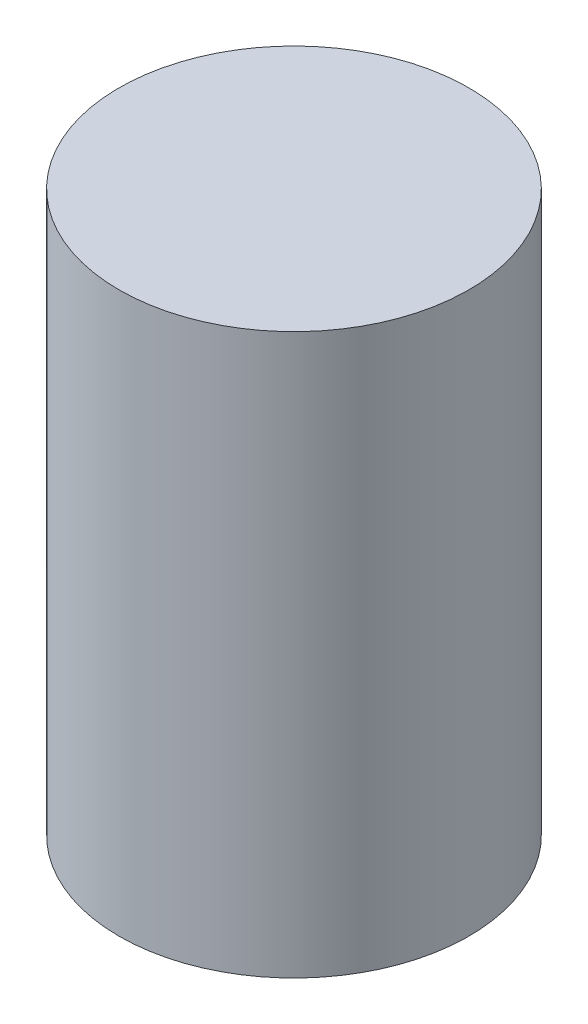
from build123d import *

# Parameters (mm, degrees)
SKETCH_2_R = 25


with BuildPart() as part:
    # Sweep 1: sweep along a path in Sketch 1
    with BuildLine(Plane.XY) as sweep_1_path:
        Line((0, 0), (0, 80))
    # Sketch 2 → Sweep 1 (sweep)
    with BuildSketch(Plane(origin=(0, 0, 0), x_dir=(1, 0, 0), z_dir=(0, 1, 0))):
        Circle(SKETCH_2_R)
    sweep(path=sweep_1_path.line)


solid = part.part
